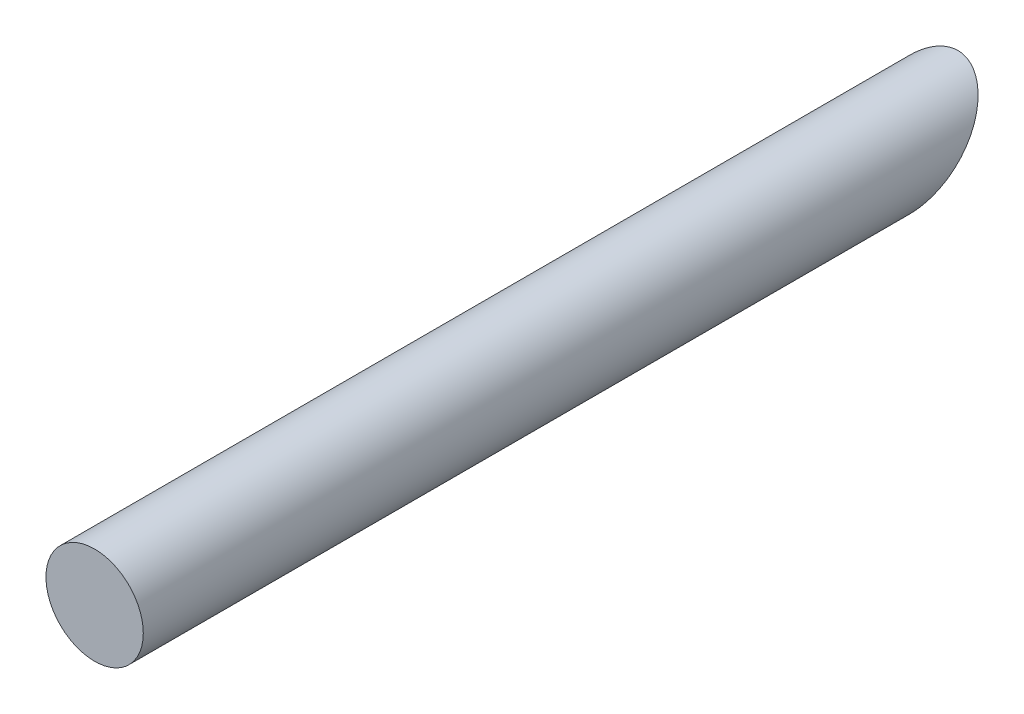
from build123d import *

# Parameters (mm, degrees)
ESQUISSE1_R             = 3.1
EXTRUSION1_DEPTH        = 55
ENL_V_MAT_EXTRU_1_DEPTH = 5


with BuildPart() as part:
    # Esquisse1 → Extrusion1 (new body)
    with BuildSketch(Plane.XY):
        Circle(ESQUISSE1_R)
    extrude(amount=EXTRUSION1_DEPTH)

    # Esquisse2 → Enl_v. mat.-Extru.1 (cut, symmetric)
    with BuildSketch(Plane(origin=(0, 0, 0), x_dir=(0, 0, -1), z_dir=(1, 0, 0))):
        Polygon((-8.437236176, -5.337236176), (1.467235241, 4.567235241), (1.467235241, -5.337236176), align=None)
    extrude(amount=ENL_V_MAT_EXTRU_1_DEPTH, both=True, mode=Mode.SUBTRACT)


solid = part.part
